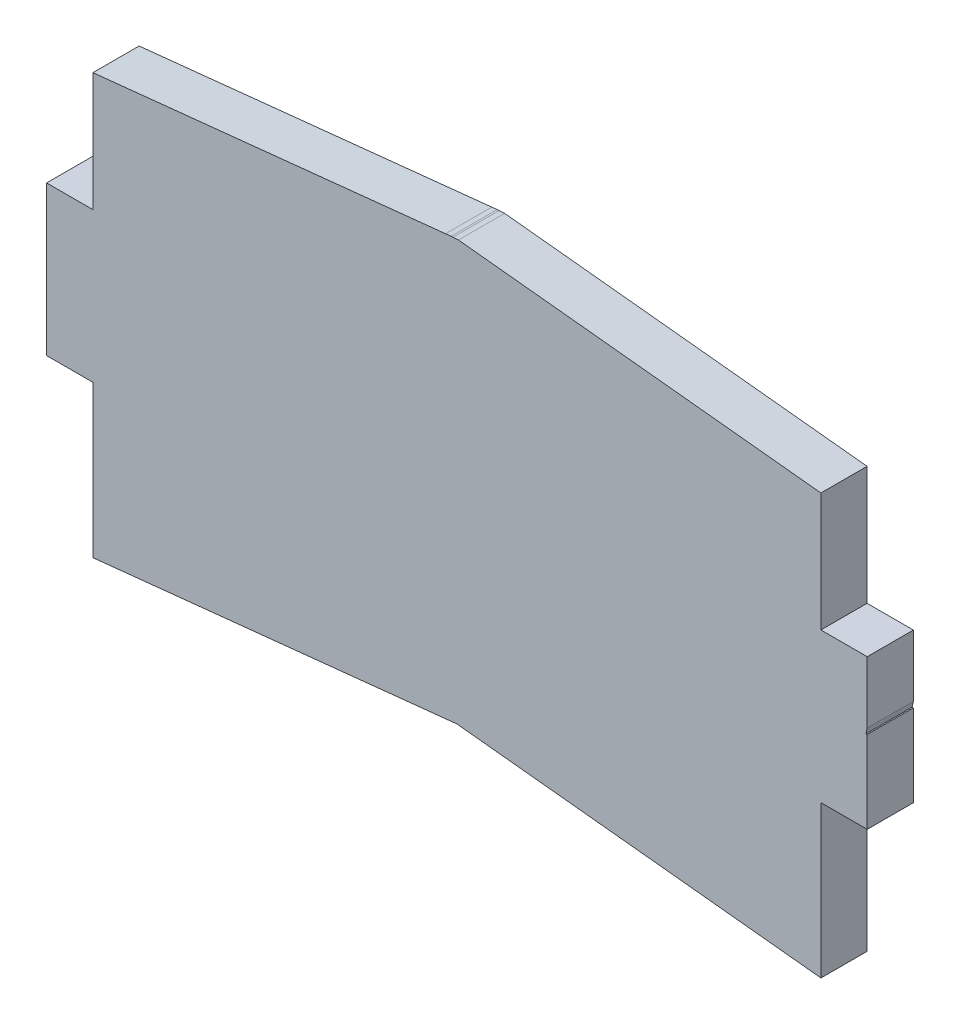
ISO-10303-21;
HEADER;
FILE_DESCRIPTION(('STEP AP214'),'2;1');
FILE_NAME('part.step','',(''),(''),'','','');
FILE_SCHEMA(('AUTOMOTIVE_DESIGN { 1 0 10303 214 1 1 1 1 }'));
ENDSEC;
DATA;
#1=APPLICATION_CONTEXT('core data for automotive mechanical design processes');
#2=APPLICATION_PROTOCOL_DEFINITION('international standard','automotive_design',2000,#1);
#3=PRODUCT_CONTEXT('',#1,'mechanical');
#4=PRODUCT('Part','Part','',(#3));
#5=PRODUCT_RELATED_PRODUCT_CATEGORY('part','',(#4));
#6=PRODUCT_DEFINITION_FORMATION('','',#4);
#7=PRODUCT_DEFINITION_CONTEXT('part definition',#1,'design');
#8=PRODUCT_DEFINITION('design','',#6,#7);
#9=PRODUCT_DEFINITION_SHAPE('','',#8);
#10=(LENGTH_UNIT() NAMED_UNIT(*) SI_UNIT(.MILLI.,.METRE.));
#11=(NAMED_UNIT(*) PLANE_ANGLE_UNIT() SI_UNIT($,.RADIAN.));
#12=(NAMED_UNIT(*) SI_UNIT($,.STERADIAN.) SOLID_ANGLE_UNIT());
#13=UNCERTAINTY_MEASURE_WITH_UNIT(LENGTH_MEASURE(1.E-05),#10,'distance_accuracy_value','');
#14=(GEOMETRIC_REPRESENTATION_CONTEXT(3) GLOBAL_UNCERTAINTY_ASSIGNED_CONTEXT((#13)) GLOBAL_UNIT_ASSIGNED_CONTEXT((#10,
#11,#12)) REPRESENTATION_CONTEXT('',''));
#15=CARTESIAN_POINT('',(0.,0.,0.));
#16=DIRECTION('',(0.,0.,1.));
#17=DIRECTION('',(1.,0.,0.));
#18=AXIS2_PLACEMENT_3D('',#15,#16,#17);
#19=CARTESIAN_POINT('',(309.629505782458,356.119192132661,3.));
#20=CARTESIAN_POINT('',(309.601083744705,356.117641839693,3.));
#21=CARTESIAN_POINT('',(309.572661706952,356.115488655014,3.));
#22=CARTESIAN_POINT('',(309.544239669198,356.114024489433,3.));
#23=B_SPLINE_CURVE_WITH_KNOTS('',3,(#19,#20,#21,#22),.UNSPECIFIED.,.F.,.F.,(4,4),(0.,1.),.UNSPECIFIED.);
#24=DIRECTION('',(0.,0.,-1.));
#25=VECTOR('',#24,1.);
#26=SURFACE_OF_LINEAR_EXTRUSION('',#23,#25);
#27=CARTESIAN_POINT('',(309.629505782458,356.119192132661,0.));
#28=CARTESIAN_POINT('',(309.601083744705,356.117641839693,0.));
#29=CARTESIAN_POINT('',(309.572661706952,356.115488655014,0.));
#30=CARTESIAN_POINT('',(309.544239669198,356.114024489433,0.));
#31=B_SPLINE_CURVE_WITH_KNOTS('',3,(#27,#28,#29,#30),.UNSPECIFIED.,.F.,.F.,(4,4),(0.,1.),.UNSPECIFIED.);
#32=CARTESIAN_POINT('',(309.629505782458,356.119192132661,0.));
#33=VERTEX_POINT('',#32);
#34=CARTESIAN_POINT('',(309.544239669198,356.114024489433,0.));
#35=VERTEX_POINT('',#34);
#36=EDGE_CURVE('E11',#33,#35,#31,.T.);
#37=ORIENTED_EDGE('',*,*,#36,.T.);
#38=DIRECTION('',(0.,0.,-1.));
#39=VECTOR('',#38,1.);
#40=CARTESIAN_POINT('',(309.544239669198,356.114024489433,3.));
#41=LINE('',#40,#39);
#42=CARTESIAN_POINT('',(309.544239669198,356.114024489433,3.));
#43=VERTEX_POINT('',#42);
#44=EDGE_CURVE('E558',#43,#35,#41,.T.);
#45=ORIENTED_EDGE('',*,*,#44,.F.);
#46=CARTESIAN_POINT('',(309.629505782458,356.119192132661,3.));
#47=VERTEX_POINT('',#46);
#48=EDGE_CURVE('E47',#47,#43,#23,.T.);
#49=ORIENTED_EDGE('',*,*,#48,.F.);
#50=DIRECTION('',(0.,0.,-1.));
#51=VECTOR('',#50,1.);
#52=CARTESIAN_POINT('',(309.629505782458,356.119192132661,3.));
#53=LINE('',#52,#51);
#54=EDGE_CURVE('E257',#47,#33,#53,.T.);
#55=ORIENTED_EDGE('',*,*,#54,.T.);
#56=EDGE_LOOP('',(#37,#45,#49,#55));
#57=FACE_BOUND('',#56,.T.);
#58=ADVANCED_FACE('F44',(#57),#26,.F.);
#59=CARTESIAN_POINT('',(309.629505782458,356.479376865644,3.));
#60=DIRECTION('',(-0.973831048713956,0.227273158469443,0.));
#61=DIRECTION('',(-0.227273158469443,-0.973831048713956,0.));
#62=AXIS2_PLACEMENT_3D('',#59,#60,#61);
#63=PLANE('',#62);
#64=DIRECTION('',(0.227273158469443,0.973831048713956,0.));
#65=VECTOR('',#64,1.);
#66=CARTESIAN_POINT('',(309.629505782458,356.479376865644,0.));
#67=LINE('',#66,#65);
#68=CARTESIAN_POINT('',(309.629505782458,356.479376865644,0.));
#69=VERTEX_POINT('',#68);
#70=EDGE_CURVE('E56',#35,#69,#67,.T.);
#71=ORIENTED_EDGE('',*,*,#70,.T.);
#72=DIRECTION('',(0.,0.,-1.));
#73=VECTOR('',#72,1.);
#74=CARTESIAN_POINT('',(309.629505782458,356.479376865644,3.));
#75=LINE('',#74,#73);
#76=CARTESIAN_POINT('',(309.629505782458,356.479376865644,3.));
#77=VERTEX_POINT('',#76);
#78=EDGE_CURVE('E221',#77,#69,#75,.T.);
#79=ORIENTED_EDGE('',*,*,#78,.F.);
#80=DIRECTION('',(0.227273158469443,0.973831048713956,0.));
#81=VECTOR('',#80,1.);
#82=CARTESIAN_POINT('',(309.629505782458,356.479376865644,3.));
#83=LINE('',#82,#81);
#84=EDGE_CURVE('E141',#43,#77,#83,.T.);
#85=ORIENTED_EDGE('',*,*,#84,.F.);
#86=ORIENTED_EDGE('',*,*,#44,.T.);
#87=EDGE_LOOP('',(#71,#79,#85,#86));
#88=FACE_BOUND('',#87,.T.);
#89=ADVANCED_FACE('F556',(#88),#63,.F.);
#90=CARTESIAN_POINT('',(309.629505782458,360.496702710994,3.));
#91=DIRECTION('',(-1.,0.,0.));
#92=DIRECTION('',(0.,0.,1.));
#93=AXIS2_PLACEMENT_3D('',#90,#91,#92);
#94=PLANE('',#93);
#95=DIRECTION('',(0.,1.,0.));
#96=VECTOR('',#95,1.);
#97=CARTESIAN_POINT('',(309.629505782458,360.496702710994,0.));
#98=LINE('',#97,#96);
#99=CARTESIAN_POINT('',(309.629505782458,360.496702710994,0.));
#100=VERTEX_POINT('',#99);
#101=EDGE_CURVE('E216',#69,#100,#98,.T.);
#102=ORIENTED_EDGE('',*,*,#101,.T.);
#103=DIRECTION('',(0.,0.,-1.));
#104=VECTOR('',#103,1.);
#105=CARTESIAN_POINT('',(309.629505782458,360.496702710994,3.));
#106=LINE('',#105,#104);
#107=CARTESIAN_POINT('',(309.629505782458,360.496702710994,3.));
#108=VERTEX_POINT('',#107);
#109=EDGE_CURVE('E222',#108,#100,#106,.T.);
#110=ORIENTED_EDGE('',*,*,#109,.F.);
#111=DIRECTION('',(0.,1.,0.));
#112=VECTOR('',#111,1.);
#113=CARTESIAN_POINT('',(309.629505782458,360.496702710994,3.));
#114=LINE('',#113,#112);
#115=EDGE_CURVE('E316',#77,#108,#114,.T.);
#116=ORIENTED_EDGE('',*,*,#115,.F.);
#117=ORIENTED_EDGE('',*,*,#78,.T.);
#118=EDGE_LOOP('',(#102,#110,#116,#117));
#119=FACE_BOUND('',#118,.T.);
#120=ADVANCED_FACE('F223',(#119),#94,.F.);
#121=CARTESIAN_POINT('',(306.620990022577,360.496702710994,3.));
#122=DIRECTION('',(0.,-1.,0.));
#123=DIRECTION('',(0.,0.,-1.));
#124=AXIS2_PLACEMENT_3D('',#121,#122,#123);
#125=PLANE('',#124);
#126=DIRECTION('',(-1.,0.,0.));
#127=VECTOR('',#126,1.);
#128=CARTESIAN_POINT('',(306.620990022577,360.496702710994,0.));
#129=LINE('',#128,#127);
#130=CARTESIAN_POINT('',(306.620990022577,360.496702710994,0.));
#131=VERTEX_POINT('',#130);
#132=EDGE_CURVE('E226',#100,#131,#129,.T.);
#133=ORIENTED_EDGE('',*,*,#132,.T.);
#134=DIRECTION('',(0.,0.,-1.));
#135=VECTOR('',#134,1.);
#136=CARTESIAN_POINT('',(306.620990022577,360.496702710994,3.));
#137=LINE('',#136,#135);
#138=CARTESIAN_POINT('',(306.620990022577,360.496702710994,3.));
#139=VERTEX_POINT('',#138);
#140=EDGE_CURVE('E236',#139,#131,#137,.T.);
#141=ORIENTED_EDGE('',*,*,#140,.F.);
#142=DIRECTION('',(-1.,0.,0.));
#143=VECTOR('',#142,1.);
#144=CARTESIAN_POINT('',(306.620990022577,360.496702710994,3.));
#145=LINE('',#144,#143);
#146=EDGE_CURVE('E234',#108,#139,#145,.T.);
#147=ORIENTED_EDGE('',*,*,#146,.F.);
#148=ORIENTED_EDGE('',*,*,#109,.T.);
#149=EDGE_LOOP('',(#133,#141,#147,#148));
#150=FACE_BOUND('',#149,.T.);
#151=ADVANCED_FACE('F233',(#150),#125,.F.);
#152=CARTESIAN_POINT('',(306.620990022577,368.205792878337,3.));
#153=DIRECTION('',(-1.,0.,0.));
#154=DIRECTION('',(0.,0.,1.));
#155=AXIS2_PLACEMENT_3D('',#152,#153,#154);
#156=PLANE('',#155);
#157=DIRECTION('',(0.,1.,0.));
#158=VECTOR('',#157,1.);
#159=CARTESIAN_POINT('',(306.620990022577,368.205792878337,0.));
#160=LINE('',#159,#158);
#161=CARTESIAN_POINT('',(306.620990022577,368.205792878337,0.));
#162=VERTEX_POINT('',#161);
#163=EDGE_CURVE('E241',#131,#162,#160,.T.);
#164=ORIENTED_EDGE('',*,*,#163,.T.);
#165=DIRECTION('',(0.,0.,-1.));
#166=VECTOR('',#165,1.);
#167=CARTESIAN_POINT('',(306.620990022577,368.205792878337,3.));
#168=LINE('',#167,#166);
#169=CARTESIAN_POINT('',(306.620990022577,368.205792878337,3.));
#170=VERTEX_POINT('',#169);
#171=EDGE_CURVE('E392',#170,#162,#168,.T.);
#172=ORIENTED_EDGE('',*,*,#171,.F.);
#173=DIRECTION('',(0.,1.,0.));
#174=VECTOR('',#173,1.);
#175=CARTESIAN_POINT('',(306.620990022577,368.205792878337,3.));
#176=LINE('',#175,#174);
#177=EDGE_CURVE('E313',#139,#170,#176,.T.);
#178=ORIENTED_EDGE('',*,*,#177,.F.);
#179=ORIENTED_EDGE('',*,*,#140,.T.);
#180=EDGE_LOOP('',(#164,#172,#178,#179));
#181=FACE_BOUND('',#180,.T.);
#182=ADVANCED_FACE('F547',(#181),#156,.F.);
#183=CARTESIAN_POINT('',(283.06984358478,370.664815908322,3.));
#184=DIRECTION('',(-0.103847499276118,-0.994593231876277,0.));
#185=DIRECTION('',(0.994593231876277,-0.103847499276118,0.));
#186=AXIS2_PLACEMENT_3D('',#183,#184,#185);
#187=PLANE('',#186);
#188=DIRECTION('',(-0.994593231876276,0.103847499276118,0.));
#189=VECTOR('',#188,1.);
#190=CARTESIAN_POINT('',(283.06984358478,370.664815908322,0.));
#191=LINE('',#190,#189);
#192=CARTESIAN_POINT('',(283.06984358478,370.664815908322,0.));
#193=VERTEX_POINT('',#192);
#194=EDGE_CURVE('E244',#162,#193,#191,.T.);
#195=ORIENTED_EDGE('',*,*,#194,.T.);
#196=DIRECTION('',(0.,0.,-1.));
#197=VECTOR('',#196,1.);
#198=CARTESIAN_POINT('',(283.06984358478,370.664815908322,3.));
#199=LINE('',#198,#197);
#200=CARTESIAN_POINT('',(283.06984358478,370.664815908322,3.));
#201=VERTEX_POINT('',#200);
#202=EDGE_CURVE('E390',#201,#193,#199,.T.);
#203=ORIENTED_EDGE('',*,*,#202,.F.);
#204=DIRECTION('',(-0.994593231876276,0.103847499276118,0.));
#205=VECTOR('',#204,1.);
#206=CARTESIAN_POINT('',(283.06984358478,370.664815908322,3.));
#207=LINE('',#206,#205);
#208=EDGE_CURVE('E311',#170,#201,#207,.T.);
#209=ORIENTED_EDGE('',*,*,#208,.F.);
#210=ORIENTED_EDGE('',*,*,#171,.T.);
#211=EDGE_LOOP('',(#195,#203,#209,#210));
#212=FACE_BOUND('',#211,.T.);
#213=ADVANCED_FACE('F389',(#212),#187,.F.);
#214=CARTESIAN_POINT('',(282.720123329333,370.649226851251,3.));
#215=DIRECTION('',(0.044531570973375,-0.99900797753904,0.));
#216=DIRECTION('',(0.99900797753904,0.044531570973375,0.));
#217=AXIS2_PLACEMENT_3D('',#214,#215,#216);
#218=PLANE('',#217);
#219=DIRECTION('',(-0.99900797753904,-0.044531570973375,0.));
#220=VECTOR('',#219,1.);
#221=CARTESIAN_POINT('',(282.720123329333,370.649226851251,0.));
#222=LINE('',#221,#220);
#223=CARTESIAN_POINT('',(282.720123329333,370.649226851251,0.));
#224=VERTEX_POINT('',#223);
#225=EDGE_CURVE('E378',#193,#224,#222,.T.);
#226=ORIENTED_EDGE('',*,*,#225,.T.);
#227=DIRECTION('',(0.,0.,-1.));
#228=VECTOR('',#227,1.);
#229=CARTESIAN_POINT('',(282.720123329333,370.649226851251,3.));
#230=LINE('',#229,#228);
#231=CARTESIAN_POINT('',(282.720123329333,370.649226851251,3.));
#232=VERTEX_POINT('',#231);
#233=EDGE_CURVE('E397',#232,#224,#230,.T.);
#234=ORIENTED_EDGE('',*,*,#233,.F.);
#235=DIRECTION('',(-0.99900797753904,-0.044531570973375,0.));
#236=VECTOR('',#235,1.);
#237=CARTESIAN_POINT('',(282.720123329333,370.649226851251,3.));
#238=LINE('',#237,#236);
#239=EDGE_CURVE('E308',#201,#232,#238,.T.);
#240=ORIENTED_EDGE('',*,*,#239,.F.);
#241=ORIENTED_EDGE('',*,*,#202,.T.);
#242=EDGE_LOOP('',(#226,#234,#240,#241));
#243=FACE_BOUND('',#242,.T.);
#244=ADVANCED_FACE('F391',(#243),#218,.F.);
#245=CARTESIAN_POINT('',(282.590070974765,370.635618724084,3.));
#246=DIRECTION('',(0.104067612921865,-0.994570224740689,0.));
#247=DIRECTION('',(0.994570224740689,0.104067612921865,0.));
#248=AXIS2_PLACEMENT_3D('',#245,#246,#247);
#249=PLANE('',#248);
#250=DIRECTION('',(-0.994570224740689,-0.104067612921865,0.));
#251=VECTOR('',#250,1.);
#252=CARTESIAN_POINT('',(282.590070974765,370.635618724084,0.));
#253=LINE('',#252,#251);
#254=CARTESIAN_POINT('',(282.590070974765,370.635618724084,0.));
#255=VERTEX_POINT('',#254);
#256=EDGE_CURVE('E376',#224,#255,#253,.T.);
#257=ORIENTED_EDGE('',*,*,#256,.T.);
#258=DIRECTION('',(0.,0.,-1.));
#259=VECTOR('',#258,1.);
#260=CARTESIAN_POINT('',(282.590070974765,370.635618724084,3.));
#261=LINE('',#260,#259);
#262=CARTESIAN_POINT('',(282.590070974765,370.635618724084,3.));
#263=VERTEX_POINT('',#262);
#264=EDGE_CURVE('E410',#263,#255,#261,.T.);
#265=ORIENTED_EDGE('',*,*,#264,.F.);
#266=DIRECTION('',(-0.994570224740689,-0.104067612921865,0.));
#267=VECTOR('',#266,1.);
#268=CARTESIAN_POINT('',(282.590070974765,370.635618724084,3.));
#269=LINE('',#268,#267);
#270=EDGE_CURVE('E304',#232,#263,#269,.T.);
#271=ORIENTED_EDGE('',*,*,#270,.F.);
#272=ORIENTED_EDGE('',*,*,#233,.T.);
#273=EDGE_LOOP('',(#257,#265,#271,#272));
#274=FACE_BOUND('',#273,.T.);
#275=ADVANCED_FACE('F409',(#274),#249,.F.);
#276=CARTESIAN_POINT('',(282.235096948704,370.598583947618,3.));
#277=DIRECTION('',(0.103767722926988,-0.994601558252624,0.));
#278=DIRECTION('',(0.994601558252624,0.103767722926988,0.));
#279=AXIS2_PLACEMENT_3D('',#276,#277,#278);
#280=PLANE('',#279);
#281=DIRECTION('',(-0.994601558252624,-0.103767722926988,0.));
#282=VECTOR('',#281,1.);
#283=CARTESIAN_POINT('',(282.235096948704,370.598583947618,0.));
#284=LINE('',#283,#282);
#285=CARTESIAN_POINT('',(282.235096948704,370.598583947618,0.));
#286=VERTEX_POINT('',#285);
#287=EDGE_CURVE('E373',#255,#286,#284,.T.);
#288=ORIENTED_EDGE('',*,*,#287,.T.);
#289=DIRECTION('',(0.,0.,-1.));
#290=VECTOR('',#289,1.);
#291=CARTESIAN_POINT('',(282.235096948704,370.598583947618,3.));
#292=LINE('',#291,#290);
#293=CARTESIAN_POINT('',(282.235096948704,370.598583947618,3.));
#294=VERTEX_POINT('',#293);
#295=EDGE_CURVE('E413',#294,#286,#292,.T.);
#296=ORIENTED_EDGE('',*,*,#295,.F.);
#297=DIRECTION('',(-0.994601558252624,-0.103767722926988,0.));
#298=VECTOR('',#297,1.);
#299=CARTESIAN_POINT('',(282.235096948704,370.598583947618,3.));
#300=LINE('',#299,#298);
#301=EDGE_CURVE('E305',#263,#294,#300,.T.);
#302=ORIENTED_EDGE('',*,*,#301,.F.);
#303=ORIENTED_EDGE('',*,*,#264,.T.);
#304=EDGE_LOOP('',(#288,#296,#302,#303));
#305=FACE_BOUND('',#304,.T.);
#306=ADVANCED_FACE('F412',(#305),#280,.F.);
#307=CARTESIAN_POINT('',(259.318580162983,368.205792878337,3.));
#308=DIRECTION('',(0.103848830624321,-0.994593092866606,0.));
#309=DIRECTION('',(0.994593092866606,0.103848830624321,0.));
#310=AXIS2_PLACEMENT_3D('',#307,#308,#309);
#311=PLANE('',#310);
#312=DIRECTION('',(-0.994593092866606,-0.103848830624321,0.));
#313=VECTOR('',#312,1.);
#314=CARTESIAN_POINT('',(259.318580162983,368.205792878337,0.));
#315=LINE('',#314,#313);
#316=CARTESIAN_POINT('',(259.318580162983,368.205792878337,0.));
#317=VERTEX_POINT('',#316);
#318=EDGE_CURVE('E369',#286,#317,#315,.T.);
#319=ORIENTED_EDGE('',*,*,#318,.T.);
#320=DIRECTION('',(0.,0.,-1.));
#321=VECTOR('',#320,1.);
#322=CARTESIAN_POINT('',(259.318580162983,368.205792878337,3.));
#323=LINE('',#322,#321);
#324=CARTESIAN_POINT('',(259.318580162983,368.205792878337,3.));
#325=VERTEX_POINT('',#324);
#326=EDGE_CURVE('E420',#325,#317,#323,.T.);
#327=ORIENTED_EDGE('',*,*,#326,.F.);
#328=DIRECTION('',(-0.994593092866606,-0.103848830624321,0.));
#329=VECTOR('',#328,1.);
#330=CARTESIAN_POINT('',(259.318580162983,368.205792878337,3.));
#331=LINE('',#330,#329);
#332=EDGE_CURVE('E299',#294,#325,#331,.T.);
#333=ORIENTED_EDGE('',*,*,#332,.F.);
#334=ORIENTED_EDGE('',*,*,#295,.T.);
#335=EDGE_LOOP('',(#319,#327,#333,#334));
#336=FACE_BOUND('',#335,.T.);
#337=ADVANCED_FACE('F543',(#336),#311,.F.);
#338=CARTESIAN_POINT('',(259.318580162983,360.496702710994,3.));
#339=DIRECTION('',(1.,0.,0.));
#340=DIRECTION('',(0.,0.,-1.));
#341=AXIS2_PLACEMENT_3D('',#338,#339,#340);
#342=PLANE('',#341);
#343=DIRECTION('',(0.,-1.,0.));
#344=VECTOR('',#343,1.);
#345=CARTESIAN_POINT('',(259.318580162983,360.496702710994,0.));
#346=LINE('',#345,#344);
#347=CARTESIAN_POINT('',(259.318580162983,360.496702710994,0.));
#348=VERTEX_POINT('',#347);
#349=EDGE_CURVE('E370',#317,#348,#346,.T.);
#350=ORIENTED_EDGE('',*,*,#349,.T.);
#351=DIRECTION('',(0.,0.,-1.));
#352=VECTOR('',#351,1.);
#353=CARTESIAN_POINT('',(259.318580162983,360.496702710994,3.));
#354=LINE('',#353,#352);
#355=CARTESIAN_POINT('',(259.318580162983,360.496702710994,3.));
#356=VERTEX_POINT('',#355);
#357=EDGE_CURVE('E428',#356,#348,#354,.T.);
#358=ORIENTED_EDGE('',*,*,#357,.F.);
#359=DIRECTION('',(0.,-1.,0.));
#360=VECTOR('',#359,1.);
#361=CARTESIAN_POINT('',(259.318580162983,360.496702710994,3.));
#362=LINE('',#361,#360);
#363=EDGE_CURVE('E298',#325,#356,#362,.T.);
#364=ORIENTED_EDGE('',*,*,#363,.F.);
#365=ORIENTED_EDGE('',*,*,#326,.T.);
#366=EDGE_LOOP('',(#350,#358,#364,#365));
#367=FACE_BOUND('',#366,.T.);
#368=ADVANCED_FACE('F537',(#367),#342,.F.);
#369=CARTESIAN_POINT('',(256.310021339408,360.496702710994,3.));
#370=DIRECTION('',(0.,-1.,0.));
#371=DIRECTION('',(0.,0.,-1.));
#372=AXIS2_PLACEMENT_3D('',#369,#370,#371);
#373=PLANE('',#372);
#374=DIRECTION('',(-1.,0.,0.));
#375=VECTOR('',#374,1.);
#376=CARTESIAN_POINT('',(256.310021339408,360.496702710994,0.));
#377=LINE('',#376,#375);
#378=CARTESIAN_POINT('',(256.310021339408,360.496702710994,0.));
#379=VERTEX_POINT('',#378);
#380=EDGE_CURVE('E361',#348,#379,#377,.T.);
#381=ORIENTED_EDGE('',*,*,#380,.T.);
#382=DIRECTION('',(0.,0.,-1.));
#383=VECTOR('',#382,1.);
#384=CARTESIAN_POINT('',(256.310021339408,360.496702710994,3.));
#385=LINE('',#384,#383);
#386=CARTESIAN_POINT('',(256.310021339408,360.496702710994,3.));
#387=VERTEX_POINT('',#386);
#388=EDGE_CURVE('E427',#387,#379,#385,.T.);
#389=ORIENTED_EDGE('',*,*,#388,.F.);
#390=DIRECTION('',(-1.,0.,0.));
#391=VECTOR('',#390,1.);
#392=CARTESIAN_POINT('',(256.310021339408,360.496702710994,3.));
#393=LINE('',#392,#391);
#394=EDGE_CURVE('E291',#356,#387,#393,.T.);
#395=ORIENTED_EDGE('',*,*,#394,.F.);
#396=ORIENTED_EDGE('',*,*,#357,.T.);
#397=EDGE_LOOP('',(#381,#389,#395,#396));
#398=FACE_BOUND('',#397,.T.);
#399=ADVANCED_FACE('F539',(#398),#373,.F.);
#400=CARTESIAN_POINT('',(256.310021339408,350.780069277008,3.));
#401=DIRECTION('',(1.,0.,0.));
#402=DIRECTION('',(0.,0.,-1.));
#403=AXIS2_PLACEMENT_3D('',#400,#401,#402);
#404=PLANE('',#403);
#405=DIRECTION('',(0.,-1.,0.));
#406=VECTOR('',#405,1.);
#407=CARTESIAN_POINT('',(256.310021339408,350.780069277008,0.));
#408=LINE('',#407,#406);
#409=CARTESIAN_POINT('',(256.310021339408,350.780069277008,0.));
#410=VERTEX_POINT('',#409);
#411=EDGE_CURVE('E359',#379,#410,#408,.T.);
#412=ORIENTED_EDGE('',*,*,#411,.T.);
#413=DIRECTION('',(0.,0.,-1.));
#414=VECTOR('',#413,1.);
#415=CARTESIAN_POINT('',(256.310021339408,350.780069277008,3.));
#416=LINE('',#415,#414);
#417=CARTESIAN_POINT('',(256.310021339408,350.780069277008,3.));
#418=VERTEX_POINT('',#417);
#419=EDGE_CURVE('E432',#418,#410,#416,.T.);
#420=ORIENTED_EDGE('',*,*,#419,.F.);
#421=DIRECTION('',(0.,-1.,0.));
#422=VECTOR('',#421,1.);
#423=CARTESIAN_POINT('',(256.310021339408,355.460748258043,3.));
#424=LINE('',#423,#422);
#425=EDGE_CURVE('E286',#387,#418,#424,.T.);
#426=ORIENTED_EDGE('',*,*,#425,.F.);
#427=ORIENTED_EDGE('',*,*,#388,.T.);
#428=EDGE_LOOP('',(#412,#420,#426,#427));
#429=FACE_BOUND('',#428,.T.);
#430=ADVANCED_FACE('F535',(#429),#404,.F.);
#431=CARTESIAN_POINT('',(259.318580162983,350.780069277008,3.));
#432=DIRECTION('',(0.,1.,0.));
#433=DIRECTION('',(0.,0.,1.));
#434=AXIS2_PLACEMENT_3D('',#431,#432,#433);
#435=PLANE('',#434);
#436=DIRECTION('',(1.,0.,0.));
#437=VECTOR('',#436,1.);
#438=CARTESIAN_POINT('',(259.318580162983,350.780069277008,0.));
#439=LINE('',#438,#437);
#440=CARTESIAN_POINT('',(259.318580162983,350.780069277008,0.));
#441=VERTEX_POINT('',#440);
#442=EDGE_CURVE('E357',#410,#441,#439,.T.);
#443=ORIENTED_EDGE('',*,*,#442,.T.);
#444=DIRECTION('',(0.,0.,-1.));
#445=VECTOR('',#444,1.);
#446=CARTESIAN_POINT('',(259.318580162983,350.780069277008,3.));
#447=LINE('',#446,#445);
#448=CARTESIAN_POINT('',(259.318580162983,350.780069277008,3.));
#449=VERTEX_POINT('',#448);
#450=EDGE_CURVE('E438',#449,#441,#447,.T.);
#451=ORIENTED_EDGE('',*,*,#450,.F.);
#452=DIRECTION('',(1.,0.,0.));
#453=VECTOR('',#452,1.);
#454=CARTESIAN_POINT('',(259.318580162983,350.780069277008,3.));
#455=LINE('',#454,#453);
#456=EDGE_CURVE('E289',#418,#449,#455,.T.);
#457=ORIENTED_EDGE('',*,*,#456,.F.);
#458=ORIENTED_EDGE('',*,*,#419,.T.);
#459=EDGE_LOOP('',(#443,#451,#457,#458));
#460=FACE_BOUND('',#459,.T.);
#461=ADVANCED_FACE('F529',(#460),#435,.F.);
#462=CARTESIAN_POINT('',(259.318580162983,340.912368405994,3.));
#463=DIRECTION('',(1.,0.,0.));
#464=DIRECTION('',(0.,0.,-1.));
#465=AXIS2_PLACEMENT_3D('',#462,#463,#464);
#466=PLANE('',#465);
#467=DIRECTION('',(0.,-1.,0.));
#468=VECTOR('',#467,1.);
#469=CARTESIAN_POINT('',(259.318580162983,340.912368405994,0.));
#470=LINE('',#469,#468);
#471=CARTESIAN_POINT('',(259.318580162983,340.912368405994,0.));
#472=VERTEX_POINT('',#471);
#473=EDGE_CURVE('E355',#441,#472,#470,.T.);
#474=ORIENTED_EDGE('',*,*,#473,.T.);
#475=DIRECTION('',(0.,0.,-1.));
#476=VECTOR('',#475,1.);
#477=CARTESIAN_POINT('',(259.318580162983,340.912368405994,3.));
#478=LINE('',#477,#476);
#479=CARTESIAN_POINT('',(259.318580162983,340.912368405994,3.));
#480=VERTEX_POINT('',#479);
#481=EDGE_CURVE('E445',#480,#472,#478,.T.);
#482=ORIENTED_EDGE('',*,*,#481,.F.);
#483=DIRECTION('',(0.,-1.,0.));
#484=VECTOR('',#483,1.);
#485=CARTESIAN_POINT('',(259.318580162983,340.912368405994,3.));
#486=LINE('',#485,#484);
#487=EDGE_CURVE('E281',#449,#480,#486,.T.);
#488=ORIENTED_EDGE('',*,*,#487,.F.);
#489=ORIENTED_EDGE('',*,*,#450,.T.);
#490=EDGE_LOOP('',(#474,#482,#488,#489));
#491=FACE_BOUND('',#490,.T.);
#492=ADVANCED_FACE('F525',(#491),#466,.F.);
#493=CARTESIAN_POINT('',(281.569116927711,343.235568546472,3.));
#494=DIRECTION('',(-0.103846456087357,0.99459334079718,0.));
#495=DIRECTION('',(-0.994593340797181,-0.103846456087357,0.));
#496=AXIS2_PLACEMENT_3D('',#493,#494,#495);
#497=PLANE('',#496);
#498=DIRECTION('',(0.994593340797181,0.103846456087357,0.));
#499=VECTOR('',#498,1.);
#500=CARTESIAN_POINT('',(281.569116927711,343.235568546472,0.));
#501=LINE('',#500,#499);
#502=CARTESIAN_POINT('',(281.569116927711,343.235568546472,0.));
#503=VERTEX_POINT('',#502);
#504=EDGE_CURVE('E353',#472,#503,#501,.T.);
#505=ORIENTED_EDGE('',*,*,#504,.T.);
#506=DIRECTION('',(0.,0.,-1.));
#507=VECTOR('',#506,1.);
#508=CARTESIAN_POINT('',(281.569116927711,343.235568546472,3.));
#509=LINE('',#508,#507);
#510=CARTESIAN_POINT('',(281.569116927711,343.235568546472,3.));
#511=VERTEX_POINT('',#510);
#512=EDGE_CURVE('E447',#511,#503,#509,.T.);
#513=ORIENTED_EDGE('',*,*,#512,.F.);
#514=DIRECTION('',(0.994593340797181,0.103846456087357,0.));
#515=VECTOR('',#514,1.);
#516=CARTESIAN_POINT('',(281.569116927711,343.235568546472,3.));
#517=LINE('',#516,#515);
#518=EDGE_CURVE('E282',#480,#511,#517,.T.);
#519=ORIENTED_EDGE('',*,*,#518,.F.);
#520=ORIENTED_EDGE('',*,*,#481,.T.);
#521=EDGE_LOOP('',(#505,#513,#519,#520));
#522=FACE_BOUND('',#521,.T.);
#523=ADVANCED_FACE('F520',(#522),#497,.F.);
#524=CARTESIAN_POINT('',(281.917674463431,343.271914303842,3.));
#525=DIRECTION('',(-0.103712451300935,0.994607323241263,0.));
#526=DIRECTION('',(-0.994607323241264,-0.103712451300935,0.));
#527=AXIS2_PLACEMENT_3D('',#524,#525,#526);
#528=PLANE('',#527);
#529=DIRECTION('',(0.994607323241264,0.103712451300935,0.));
#530=VECTOR('',#529,1.);
#531=CARTESIAN_POINT('',(281.917674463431,343.271914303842,0.));
#532=LINE('',#531,#530);
#533=CARTESIAN_POINT('',(281.917674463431,343.271914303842,0.));
#534=VERTEX_POINT('',#533);
#535=EDGE_CURVE('E349',#503,#534,#532,.T.);
#536=ORIENTED_EDGE('',*,*,#535,.T.);
#537=DIRECTION('',(0.,0.,-1.));
#538=VECTOR('',#537,1.);
#539=CARTESIAN_POINT('',(281.917674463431,343.271914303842,3.));
#540=LINE('',#539,#538);
#541=CARTESIAN_POINT('',(281.917674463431,343.271914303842,3.));
#542=VERTEX_POINT('',#541);
#543=EDGE_CURVE('E448',#542,#534,#540,.T.);
#544=ORIENTED_EDGE('',*,*,#543,.F.);
#545=DIRECTION('',(0.994607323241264,0.103712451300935,0.));
#546=VECTOR('',#545,1.);
#547=CARTESIAN_POINT('',(281.917674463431,343.271914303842,3.));
#548=LINE('',#547,#546);
#549=EDGE_CURVE('E280',#511,#542,#548,.T.);
#550=ORIENTED_EDGE('',*,*,#549,.F.);
#551=ORIENTED_EDGE('',*,*,#512,.T.);
#552=EDGE_LOOP('',(#536,#544,#550,#551));
#553=FACE_BOUND('',#552,.T.);
#554=ADVANCED_FACE('F514',(#553),#528,.F.);
#555=CARTESIAN_POINT('',(282.45872670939,343.3284138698,3.));
#556=DIRECTION('',(-0.103860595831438,0.994591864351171,0.));
#557=DIRECTION('',(-0.994591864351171,-0.103860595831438,0.));
#558=AXIS2_PLACEMENT_3D('',#555,#556,#557);
#559=PLANE('',#558);
#560=DIRECTION('',(0.994591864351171,0.103860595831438,0.));
#561=VECTOR('',#560,1.);
#562=CARTESIAN_POINT('',(282.45872670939,343.3284138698,0.));
#563=LINE('',#562,#561);
#564=CARTESIAN_POINT('',(282.45872670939,343.3284138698,0.));
#565=VERTEX_POINT('',#564);
#566=EDGE_CURVE('E342',#534,#565,#563,.T.);
#567=ORIENTED_EDGE('',*,*,#566,.T.);
#568=DIRECTION('',(0.,0.,-1.));
#569=VECTOR('',#568,1.);
#570=CARTESIAN_POINT('',(282.45872670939,343.3284138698,3.));
#571=LINE('',#570,#569);
#572=CARTESIAN_POINT('',(282.45872670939,343.3284138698,3.));
#573=VERTEX_POINT('',#572);
#574=EDGE_CURVE('E453',#573,#565,#571,.T.);
#575=ORIENTED_EDGE('',*,*,#574,.F.);
#576=DIRECTION('',(0.994591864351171,0.103860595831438,0.));
#577=VECTOR('',#576,1.);
#578=CARTESIAN_POINT('',(282.45872670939,343.3284138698,3.));
#579=LINE('',#578,#577);
#580=EDGE_CURVE('E273',#542,#573,#579,.T.);
#581=ORIENTED_EDGE('',*,*,#580,.F.);
#582=ORIENTED_EDGE('',*,*,#543,.T.);
#583=EDGE_LOOP('',(#567,#575,#581,#582));
#584=FACE_BOUND('',#583,.T.);
#585=ADVANCED_FACE('F510',(#584),#559,.F.);
#586=CARTESIAN_POINT('',(282.813571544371,343.365534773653,3.));
#587=DIRECTION('',(-0.104043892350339,0.994572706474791,0.));
#588=DIRECTION('',(-0.994572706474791,-0.104043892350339,0.));
#589=AXIS2_PLACEMENT_3D('',#586,#587,#588);
#590=PLANE('',#589);
#591=DIRECTION('',(0.994572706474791,0.104043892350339,0.));
#592=VECTOR('',#591,1.);
#593=CARTESIAN_POINT('',(282.813571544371,343.365534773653,0.));
#594=LINE('',#593,#592);
#595=CARTESIAN_POINT('',(282.813571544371,343.365534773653,0.));
#596=VERTEX_POINT('',#595);
#597=EDGE_CURVE('E341',#565,#596,#594,.T.);
#598=ORIENTED_EDGE('',*,*,#597,.T.);
#599=DIRECTION('',(0.,0.,-1.));
#600=VECTOR('',#599,1.);
#601=CARTESIAN_POINT('',(282.813571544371,343.365534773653,3.));
#602=LINE('',#601,#600);
#603=CARTESIAN_POINT('',(282.813571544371,343.365534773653,3.));
#604=VERTEX_POINT('',#603);
#605=EDGE_CURVE('E459',#604,#596,#602,.T.);
#606=ORIENTED_EDGE('',*,*,#605,.F.);
#607=DIRECTION('',(0.994572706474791,0.104043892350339,0.));
#608=VECTOR('',#607,1.);
#609=CARTESIAN_POINT('',(282.813571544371,343.365534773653,3.));
#610=LINE('',#609,#608);
#611=EDGE_CURVE('E275',#573,#604,#610,.T.);
#612=ORIENTED_EDGE('',*,*,#611,.F.);
#613=ORIENTED_EDGE('',*,*,#574,.T.);
#614=EDGE_LOOP('',(#598,#606,#612,#613));
#615=FACE_BOUND('',#614,.T.);
#616=ADVANCED_FACE('F503',(#615),#590,.F.);
#617=CARTESIAN_POINT('',(282.969806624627,343.381812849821,3.));
#618=DIRECTION('',(-0.10362868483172,0.994616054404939,0.));
#619=DIRECTION('',(-0.994616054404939,-0.10362868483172,0.));
#620=AXIS2_PLACEMENT_3D('',#617,#618,#619);
#621=PLANE('',#620);
#622=DIRECTION('',(0.994616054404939,0.10362868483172,0.));
#623=VECTOR('',#622,1.);
#624=CARTESIAN_POINT('',(282.969806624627,343.381812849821,0.));
#625=LINE('',#624,#623);
#626=CARTESIAN_POINT('',(282.969806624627,343.381812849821,0.));
#627=VERTEX_POINT('',#626);
#628=EDGE_CURVE('E339',#596,#627,#625,.T.);
#629=ORIENTED_EDGE('',*,*,#628,.T.);
#630=DIRECTION('',(0.,0.,-1.));
#631=VECTOR('',#630,1.);
#632=CARTESIAN_POINT('',(282.969806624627,343.381812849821,3.));
#633=LINE('',#632,#631);
#634=CARTESIAN_POINT('',(282.969806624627,343.381812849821,3.));
#635=VERTEX_POINT('',#634);
#636=EDGE_CURVE('E464',#635,#627,#633,.T.);
#637=ORIENTED_EDGE('',*,*,#636,.F.);
#638=DIRECTION('',(0.994616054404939,0.10362868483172,0.));
#639=VECTOR('',#638,1.);
#640=CARTESIAN_POINT('',(282.969806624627,343.381812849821,3.));
#641=LINE('',#640,#639);
#642=EDGE_CURVE('E270',#604,#635,#641,.T.);
#643=ORIENTED_EDGE('',*,*,#642,.F.);
#644=ORIENTED_EDGE('',*,*,#605,.T.);
#645=EDGE_LOOP('',(#629,#637,#643,#644));
#646=FACE_BOUND('',#645,.T.);
#647=ADVANCED_FACE('F498',(#646),#621,.F.);
#648=CARTESIAN_POINT('',(306.620990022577,340.912368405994,3.));
#649=DIRECTION('',(0.103846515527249,0.994593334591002,0.));
#650=DIRECTION('',(-0.994593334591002,0.103846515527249,0.));
#651=AXIS2_PLACEMENT_3D('',#648,#649,#650);
#652=PLANE('',#651);
#653=DIRECTION('',(0.994593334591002,-0.103846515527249,0.));
#654=VECTOR('',#653,1.);
#655=CARTESIAN_POINT('',(306.620990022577,340.912368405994,0.));
#656=LINE('',#655,#654);
#657=CARTESIAN_POINT('',(306.620990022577,340.912368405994,0.));
#658=VERTEX_POINT('',#657);
#659=EDGE_CURVE('E337',#627,#658,#656,.T.);
#660=ORIENTED_EDGE('',*,*,#659,.T.);
#661=DIRECTION('',(0.,0.,-1.));
#662=VECTOR('',#661,1.);
#663=CARTESIAN_POINT('',(306.620990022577,340.912368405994,3.));
#664=LINE('',#663,#662);
#665=CARTESIAN_POINT('',(306.620990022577,340.912368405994,3.));
#666=VERTEX_POINT('',#665);
#667=EDGE_CURVE('E467',#666,#658,#664,.T.);
#668=ORIENTED_EDGE('',*,*,#667,.F.);
#669=DIRECTION('',(0.994593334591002,-0.103846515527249,0.));
#670=VECTOR('',#669,1.);
#671=CARTESIAN_POINT('',(306.620990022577,340.912368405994,3.));
#672=LINE('',#671,#670);
#673=EDGE_CURVE('E268',#635,#666,#672,.T.);
#674=ORIENTED_EDGE('',*,*,#673,.F.);
#675=ORIENTED_EDGE('',*,*,#636,.T.);
#676=EDGE_LOOP('',(#660,#668,#674,#675));
#677=FACE_BOUND('',#676,.T.);
#678=ADVANCED_FACE('F495',(#677),#652,.F.);
#679=CARTESIAN_POINT('',(306.620990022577,350.780069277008,3.));
#680=DIRECTION('',(-1.,0.,0.));
#681=DIRECTION('',(0.,0.,1.));
#682=AXIS2_PLACEMENT_3D('',#679,#680,#681);
#683=PLANE('',#682);
#684=DIRECTION('',(0.,1.,0.));
#685=VECTOR('',#684,1.);
#686=CARTESIAN_POINT('',(306.620990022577,350.780069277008,0.));
#687=LINE('',#686,#685);
#688=CARTESIAN_POINT('',(306.620990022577,350.780069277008,0.));
#689=VERTEX_POINT('',#688);
#690=EDGE_CURVE('E326',#658,#689,#687,.T.);
#691=ORIENTED_EDGE('',*,*,#690,.T.);
#692=DIRECTION('',(0.,0.,-1.));
#693=VECTOR('',#692,1.);
#694=CARTESIAN_POINT('',(306.620990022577,350.780069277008,3.));
#695=LINE('',#694,#693);
#696=CARTESIAN_POINT('',(306.620990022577,350.780069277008,3.));
#697=VERTEX_POINT('',#696);
#698=EDGE_CURVE('E468',#697,#689,#695,.T.);
#699=ORIENTED_EDGE('',*,*,#698,.F.);
#700=DIRECTION('',(0.,1.,0.));
#701=VECTOR('',#700,1.);
#702=CARTESIAN_POINT('',(306.620990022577,350.780069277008,3.));
#703=LINE('',#702,#701);
#704=EDGE_CURVE('E264',#666,#697,#703,.T.);
#705=ORIENTED_EDGE('',*,*,#704,.F.);
#706=ORIENTED_EDGE('',*,*,#667,.T.);
#707=EDGE_LOOP('',(#691,#699,#705,#706));
#708=FACE_BOUND('',#707,.T.);
#709=ADVANCED_FACE('F486',(#708),#683,.F.);
#710=CARTESIAN_POINT('',(309.629505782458,350.780069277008,3.));
#711=DIRECTION('',(0.,1.,0.));
#712=DIRECTION('',(0.,0.,1.));
#713=AXIS2_PLACEMENT_3D('',#710,#711,#712);
#714=PLANE('',#713);
#715=DIRECTION('',(1.,0.,0.));
#716=VECTOR('',#715,1.);
#717=CARTESIAN_POINT('',(309.629505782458,350.780069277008,0.));
#718=LINE('',#717,#716);
#719=CARTESIAN_POINT('',(309.629505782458,350.780069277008,0.));
#720=VERTEX_POINT('',#719);
#721=EDGE_CURVE('E327',#689,#720,#718,.T.);
#722=ORIENTED_EDGE('',*,*,#721,.T.);
#723=DIRECTION('',(0.,0.,-1.));
#724=VECTOR('',#723,1.);
#725=CARTESIAN_POINT('',(309.629505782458,350.780069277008,3.));
#726=LINE('',#725,#724);
#727=CARTESIAN_POINT('',(309.629505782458,350.780069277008,3.));
#728=VERTEX_POINT('',#727);
#729=EDGE_CURVE('E475',#728,#720,#726,.T.);
#730=ORIENTED_EDGE('',*,*,#729,.F.);
#731=DIRECTION('',(1.,0.,0.));
#732=VECTOR('',#731,1.);
#733=CARTESIAN_POINT('',(309.629505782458,350.780069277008,3.));
#734=LINE('',#733,#732);
#735=EDGE_CURVE('E258',#697,#728,#734,.T.);
#736=ORIENTED_EDGE('',*,*,#735,.F.);
#737=ORIENTED_EDGE('',*,*,#698,.T.);
#738=EDGE_LOOP('',(#722,#730,#736,#737));
#739=FACE_BOUND('',#738,.T.);
#740=ADVANCED_FACE('F482',(#739),#714,.F.);
#741=CARTESIAN_POINT('',(309.629505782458,356.119192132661,3.));
#742=DIRECTION('',(-1.,0.,0.));
#743=DIRECTION('',(0.,0.,1.));
#744=AXIS2_PLACEMENT_3D('',#741,#742,#743);
#745=PLANE('',#744);
#746=DIRECTION('',(0.,1.,0.));
#747=VECTOR('',#746,1.);
#748=CARTESIAN_POINT('',(309.629505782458,356.119192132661,0.));
#749=LINE('',#748,#747);
#750=EDGE_CURVE('E151',#720,#33,#749,.T.);
#751=ORIENTED_EDGE('',*,*,#750,.T.);
#752=ORIENTED_EDGE('',*,*,#54,.F.);
#753=DIRECTION('',(0.,1.,0.));
#754=VECTOR('',#753,1.);
#755=CARTESIAN_POINT('',(309.629505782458,356.119192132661,3.));
#756=LINE('',#755,#754);
#757=EDGE_CURVE('E254',#728,#47,#756,.T.);
#758=ORIENTED_EDGE('',*,*,#757,.F.);
#759=ORIENTED_EDGE('',*,*,#729,.T.);
#760=EDGE_LOOP('',(#751,#752,#758,#759));
#761=FACE_BOUND('',#760,.T.);
#762=ADVANCED_FACE('F609',(#761),#745,.F.);
#763=CARTESIAN_POINT('',(309.586872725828,356.116576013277,3.));
#764=DIRECTION('',(0.,0.,-1.));
#765=DIRECTION('',(-1.,0.,0.));
#766=AXIS2_PLACEMENT_3D('',#763,#764,#765);
#767=PLANE('',#766);
#768=ORIENTED_EDGE('',*,*,#48,.T.);
#769=ORIENTED_EDGE('',*,*,#84,.T.);
#770=ORIENTED_EDGE('',*,*,#115,.T.);
#771=ORIENTED_EDGE('',*,*,#146,.T.);
#772=ORIENTED_EDGE('',*,*,#177,.T.);
#773=ORIENTED_EDGE('',*,*,#208,.T.);
#774=ORIENTED_EDGE('',*,*,#239,.T.);
#775=ORIENTED_EDGE('',*,*,#270,.T.);
#776=ORIENTED_EDGE('',*,*,#301,.T.);
#777=ORIENTED_EDGE('',*,*,#332,.T.);
#778=ORIENTED_EDGE('',*,*,#363,.T.);
#779=ORIENTED_EDGE('',*,*,#394,.T.);
#780=ORIENTED_EDGE('',*,*,#425,.T.);
#781=ORIENTED_EDGE('',*,*,#456,.T.);
#782=ORIENTED_EDGE('',*,*,#487,.T.);
#783=ORIENTED_EDGE('',*,*,#518,.T.);
#784=ORIENTED_EDGE('',*,*,#549,.T.);
#785=ORIENTED_EDGE('',*,*,#580,.T.);
#786=ORIENTED_EDGE('',*,*,#611,.T.);
#787=ORIENTED_EDGE('',*,*,#642,.T.);
#788=ORIENTED_EDGE('',*,*,#673,.T.);
#789=ORIENTED_EDGE('',*,*,#704,.T.);
#790=ORIENTED_EDGE('',*,*,#735,.T.);
#791=ORIENTED_EDGE('',*,*,#757,.T.);
#792=EDGE_LOOP('',(#768,#769,#770,#771,#772,#773,#774,#775,#776,#777,#778,#779,#780,#781,#782,
#783,#784,#785,#786,#787,#788,#789,#790,#791));
#793=FACE_BOUND('',#792,.T.);
#794=ADVANCED_FACE('F50',(#793),#767,.F.);
#795=CARTESIAN_POINT('',(309.586872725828,356.116576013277,0.));
#796=DIRECTION('',(0.,0.,-1.));
#797=DIRECTION('',(-1.,0.,0.));
#798=AXIS2_PLACEMENT_3D('',#795,#796,#797);
#799=PLANE('',#798);
#800=ORIENTED_EDGE('',*,*,#36,.F.);
#801=ORIENTED_EDGE('',*,*,#750,.F.);
#802=ORIENTED_EDGE('',*,*,#721,.F.);
#803=ORIENTED_EDGE('',*,*,#690,.F.);
#804=ORIENTED_EDGE('',*,*,#659,.F.);
#805=ORIENTED_EDGE('',*,*,#628,.F.);
#806=ORIENTED_EDGE('',*,*,#597,.F.);
#807=ORIENTED_EDGE('',*,*,#566,.F.);
#808=ORIENTED_EDGE('',*,*,#535,.F.);
#809=ORIENTED_EDGE('',*,*,#504,.F.);
#810=ORIENTED_EDGE('',*,*,#473,.F.);
#811=ORIENTED_EDGE('',*,*,#442,.F.);
#812=ORIENTED_EDGE('',*,*,#411,.F.);
#813=ORIENTED_EDGE('',*,*,#380,.F.);
#814=ORIENTED_EDGE('',*,*,#349,.F.);
#815=ORIENTED_EDGE('',*,*,#318,.F.);
#816=ORIENTED_EDGE('',*,*,#287,.F.);
#817=ORIENTED_EDGE('',*,*,#256,.F.);
#818=ORIENTED_EDGE('',*,*,#225,.F.);
#819=ORIENTED_EDGE('',*,*,#194,.F.);
#820=ORIENTED_EDGE('',*,*,#163,.F.);
#821=ORIENTED_EDGE('',*,*,#132,.F.);
#822=ORIENTED_EDGE('',*,*,#101,.F.);
#823=ORIENTED_EDGE('',*,*,#70,.F.);
#824=EDGE_LOOP('',(#800,#801,#802,#803,#804,#805,#806,#807,#808,#809,#810,#811,#812,#813,#814,
#815,#816,#817,#818,#819,#820,#821,#822,#823));
#825=FACE_BOUND('',#824,.T.);
#826=ADVANCED_FACE('F237',(#825),#799,.T.);
#827=CLOSED_SHELL('',(#58,#89,#120,#151,#182,#213,#244,#275,#306,#337,#368,#399,#430,#461,#492,
#523,#554,#585,#616,#647,#678,#709,#740,#762,#794,#826));
#828=MANIFOLD_SOLID_BREP('B2',#827);
#829=ADVANCED_BREP_SHAPE_REPRESENTATION('',(#18,#828),#14);
#830=SHAPE_DEFINITION_REPRESENTATION(#9,#829);
ENDSEC;
END-ISO-10303-21;
